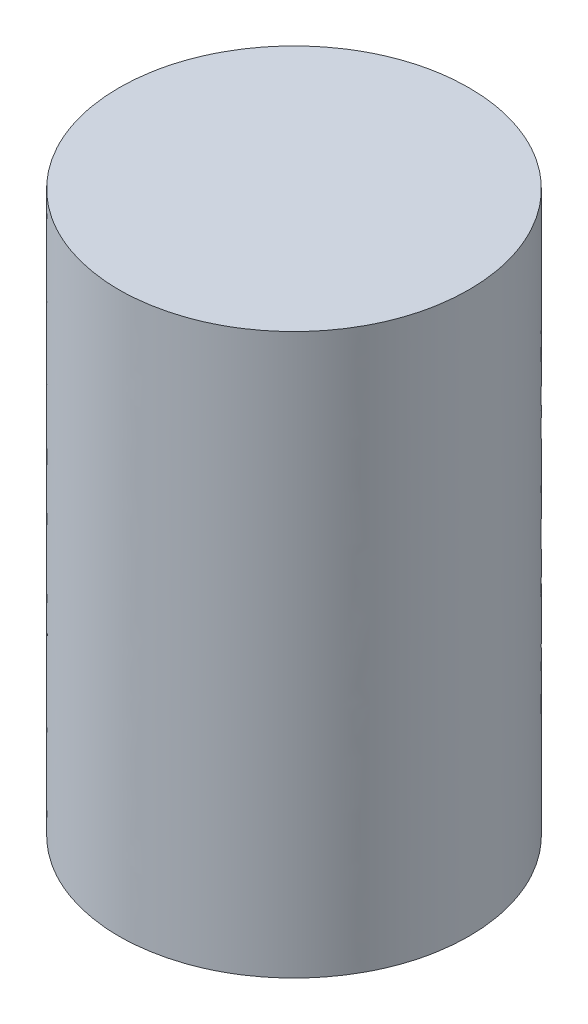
ISO-10303-21;
HEADER;
FILE_DESCRIPTION(('STEP AP214'),'2;1');
FILE_NAME('part.step','',(''),(''),'','','');
FILE_SCHEMA(('AUTOMOTIVE_DESIGN { 1 0 10303 214 1 1 1 1 }'));
ENDSEC;
DATA;
#1=APPLICATION_CONTEXT('core data for automotive mechanical design processes');
#2=APPLICATION_PROTOCOL_DEFINITION('international standard','automotive_design',2000,#1);
#3=PRODUCT_CONTEXT('',#1,'mechanical');
#4=PRODUCT('Part','Part','',(#3));
#5=PRODUCT_RELATED_PRODUCT_CATEGORY('part','',(#4));
#6=PRODUCT_DEFINITION_FORMATION('','',#4);
#7=PRODUCT_DEFINITION_CONTEXT('part definition',#1,'design');
#8=PRODUCT_DEFINITION('design','',#6,#7);
#9=PRODUCT_DEFINITION_SHAPE('','',#8);
#10=(LENGTH_UNIT() NAMED_UNIT(*) SI_UNIT(.MILLI.,.METRE.));
#11=(NAMED_UNIT(*) PLANE_ANGLE_UNIT() SI_UNIT($,.RADIAN.));
#12=(NAMED_UNIT(*) SI_UNIT($,.STERADIAN.) SOLID_ANGLE_UNIT());
#13=UNCERTAINTY_MEASURE_WITH_UNIT(LENGTH_MEASURE(1.E-05),#10,'distance_accuracy_value','');
#14=(GEOMETRIC_REPRESENTATION_CONTEXT(3) GLOBAL_UNCERTAINTY_ASSIGNED_CONTEXT((#13)) GLOBAL_UNIT_ASSIGNED_CONTEXT((#10,
#11,#12)) REPRESENTATION_CONTEXT('',''));
#15=CARTESIAN_POINT('',(0.,0.,0.));
#16=DIRECTION('',(0.,0.,1.));
#17=DIRECTION('',(1.,0.,0.));
#18=AXIS2_PLACEMENT_3D('',#15,#16,#17);
#19=CARTESIAN_POINT('',(0.,0.,0.));
#20=DIRECTION('',(0.,1.,0.));
#21=DIRECTION('',(0.,0.,1.));
#22=AXIS2_PLACEMENT_3D('',#19,#20,#21);
#23=PLANE('',#22);
#24=CARTESIAN_POINT('',(0.,0.,0.));
#25=DIRECTION('',(0.,1.,0.));
#26=DIRECTION('',(0.,0.,1.));
#27=AXIS2_PLACEMENT_3D('',#24,#25,#26);
#28=CIRCLE('',#27,25.);
#29=CARTESIAN_POINT('',(0.,0.,-25.));
#30=VERTEX_POINT('',#29);
#31=EDGE_CURVE('E57',#30,#30,#28,.T.);
#32=ORIENTED_EDGE('',*,*,#31,.F.);
#33=EDGE_LOOP('',(#32));
#34=FACE_BOUND('',#33,.T.);
#35=ADVANCED_FACE('F49',(#34),#23,.F.);
#36=CARTESIAN_POINT('',(0.,80.,0.));
#37=DIRECTION('',(0.,1.,0.));
#38=DIRECTION('',(0.,0.,1.));
#39=AXIS2_PLACEMENT_3D('',#36,#37,#38);
#40=PLANE('',#39);
#41=CARTESIAN_POINT('',(0.,80.,0.));
#42=DIRECTION('',(0.,1.,0.));
#43=DIRECTION('',(0.,0.,1.));
#44=AXIS2_PLACEMENT_3D('',#41,#42,#43);
#45=CIRCLE('',#44,25.);
#46=CARTESIAN_POINT('',(0.,80.,-25.));
#47=VERTEX_POINT('',#46);
#48=EDGE_CURVE('E12',#47,#47,#45,.T.);
#49=ORIENTED_EDGE('',*,*,#48,.T.);
#50=EDGE_LOOP('',(#49));
#51=FACE_BOUND('',#50,.T.);
#52=ADVANCED_FACE('F99',(#51),#40,.T.);
#53=CARTESIAN_POINT('',(0.,80.,-25.));
#54=CARTESIAN_POINT('',(0.,53.3333333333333,-25.));
#55=CARTESIAN_POINT('',(0.,26.6666666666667,-25.));
#56=CARTESIAN_POINT('',(0.,0.,-25.));
#57=CARTESIAN_POINT('',(0.689893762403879,80.,-25.));
#58=CARTESIAN_POINT('',(0.689893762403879,53.3333333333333,-25.));
#59=CARTESIAN_POINT('',(0.689893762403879,26.6666666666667,-25.));
#60=CARTESIAN_POINT('',(0.689893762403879,0.,-25.));
#61=CARTESIAN_POINT('',(2.05670253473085,80.,-24.9439893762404));
#62=CARTESIAN_POINT('',(2.05670253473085,53.3333333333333,-24.9439893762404));
#63=CARTESIAN_POINT('',(2.05670253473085,26.6666666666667,-24.9439893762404));
#64=CARTESIAN_POINT('',(2.05670253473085,0.,-24.9439893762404));
#65=CARTESIAN_POINT('',(4.06152465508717,80.,-24.698396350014));
#66=CARTESIAN_POINT('',(4.06152465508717,53.3333333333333,-24.698396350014));
#67=CARTESIAN_POINT('',(4.06152465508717,26.6666666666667,-24.698396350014));
#68=CARTESIAN_POINT('',(4.06152465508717,0.,-24.698396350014));
#69=CARTESIAN_POINT('',(6.01450095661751,80.,-24.2976810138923));
#70=CARTESIAN_POINT('',(6.01450095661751,53.3333333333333,-24.2976810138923));
#71=CARTESIAN_POINT('',(6.01450095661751,26.6666666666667,-24.2976810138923));
#72=CARTESIAN_POINT('',(6.01450095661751,0.,-24.2976810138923));
#73=CARTESIAN_POINT('',(17.3825551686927,80.,-21.0013838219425));
#74=CARTESIAN_POINT('',(17.3825551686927,53.3333333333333,-21.0013838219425));
#75=CARTESIAN_POINT('',(17.3825551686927,26.6666666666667,-21.0013838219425));
#76=CARTESIAN_POINT('',(17.3825551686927,0.,-21.0013838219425));
#77=CARTESIAN_POINT('',(25.,80.,-11.038300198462));
#78=CARTESIAN_POINT('',(25.,53.3333333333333,-11.038300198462));
#79=CARTESIAN_POINT('',(25.,26.6666666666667,-11.038300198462));
#80=CARTESIAN_POINT('',(25.,0.,-11.038300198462));
#81=CARTESIAN_POINT('',(25.,80.,13.7978752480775));
#82=CARTESIAN_POINT('',(25.,53.3333333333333,13.7978752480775));
#83=CARTESIAN_POINT('',(25.,26.6666666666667,13.7978752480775));
#84=CARTESIAN_POINT('',(25.,0.,13.7978752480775));
#85=CARTESIAN_POINT('',(13.7978752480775,80.,25.));
#86=CARTESIAN_POINT('',(13.7978752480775,53.3333333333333,25.));
#87=CARTESIAN_POINT('',(13.7978752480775,26.6666666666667,25.));
#88=CARTESIAN_POINT('',(13.7978752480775,0.,25.));
#89=CARTESIAN_POINT('',(-13.7978752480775,80.,25.));
#90=CARTESIAN_POINT('',(-13.7978752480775,53.3333333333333,25.));
#91=CARTESIAN_POINT('',(-13.7978752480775,26.6666666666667,25.));
#92=CARTESIAN_POINT('',(-13.7978752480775,0.,25.));
#93=CARTESIAN_POINT('',(-25.,80.,13.7978752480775));
#94=CARTESIAN_POINT('',(-25.,53.3333333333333,13.7978752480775));
#95=CARTESIAN_POINT('',(-25.,26.6666666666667,13.7978752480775));
#96=CARTESIAN_POINT('',(-25.,0.,13.7978752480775));
#97=CARTESIAN_POINT('',(-25.,80.,-11.038300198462));
#98=CARTESIAN_POINT('',(-25.,53.3333333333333,-11.038300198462));
#99=CARTESIAN_POINT('',(-25.,26.6666666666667,-11.038300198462));
#100=CARTESIAN_POINT('',(-25.,0.,-11.038300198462));
#101=CARTESIAN_POINT('',(-17.3825551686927,80.,-21.0013838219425));
#102=CARTESIAN_POINT('',(-17.3825551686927,53.3333333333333,-21.0013838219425));
#103=CARTESIAN_POINT('',(-17.3825551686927,26.6666666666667,-21.0013838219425));
#104=CARTESIAN_POINT('',(-17.3825551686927,0.,-21.0013838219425));
#105=CARTESIAN_POINT('',(-6.0145009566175,80.,-24.2976810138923));
#106=CARTESIAN_POINT('',(-6.0145009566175,53.3333333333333,-24.2976810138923));
#107=CARTESIAN_POINT('',(-6.0145009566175,26.6666666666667,-24.2976810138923));
#108=CARTESIAN_POINT('',(-6.0145009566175,0.,-24.2976810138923));
#109=CARTESIAN_POINT('',(-4.06152465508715,80.,-24.698396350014));
#110=CARTESIAN_POINT('',(-4.06152465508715,53.3333333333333,-24.698396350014));
#111=CARTESIAN_POINT('',(-4.06152465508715,26.6666666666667,-24.698396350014));
#112=CARTESIAN_POINT('',(-4.06152465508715,0.,-24.698396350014));
#113=CARTESIAN_POINT('',(-2.05670253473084,80.,-24.9439893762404));
#114=CARTESIAN_POINT('',(-2.05670253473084,53.3333333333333,-24.9439893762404));
#115=CARTESIAN_POINT('',(-2.05670253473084,26.6666666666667,-24.9439893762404));
#116=CARTESIAN_POINT('',(-2.05670253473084,0.,-24.9439893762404));
#117=CARTESIAN_POINT('',(-0.689893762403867,80.,-25.));
#118=CARTESIAN_POINT('',(-0.689893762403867,53.3333333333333,-25.));
#119=CARTESIAN_POINT('',(-0.689893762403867,26.6666666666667,-25.));
#120=CARTESIAN_POINT('',(-0.689893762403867,0.,-25.));
#121=CARTESIAN_POINT('',(0.,80.,-25.));
#122=CARTESIAN_POINT('',(0.,53.3333333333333,-25.));
#123=CARTESIAN_POINT('',(0.,26.6666666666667,-25.));
#124=CARTESIAN_POINT('',(0.,0.,-25.));
#125=B_SPLINE_SURFACE_WITH_KNOTS('',3,3,((#53,#54,#55,#56),(#57,#58,#59,#60),(#61,#62,#63,#64),
(#65,#66,#67,#68),(#69,#70,#71,#72),(#73,#74,#75,#76),(#77,#78,#79,#80),(#81,#82,#83,#84),(#85,
#86,#87,#88),(#89,#90,#91,#92),(#93,#94,#95,#96),(#97,#98,#99,#100),(#101,#102,#103,#104),(#105,
#106,#107,#108),(#109,#110,#111,#112),(#113,#114,#115,#116),(#117,#118,#119,#120),(#121,#122,
#123,#124)),.UNSPECIFIED.,.T.,.F.,.F.,(4,1,1,1,1,2,2,2,1,1,1,1,4),(4,4),(0.,0.0125,
0.0249999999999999,0.0375000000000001,0.05,0.25,0.5,0.75,0.95,0.9625,0.975,0.9875,1.),(0.,1.),.UNSPECIFIED.);
#126=CARTESIAN_POINT('',(0.,80.,-25.));
#127=CARTESIAN_POINT('',(0.,79.1666666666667,-25.));
#128=CARTESIAN_POINT('',(0.,78.3333333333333,-25.));
#129=CARTESIAN_POINT('',(0.,76.6666666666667,-25.));
#130=CARTESIAN_POINT('',(0.,75.8333333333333,-25.));
#131=CARTESIAN_POINT('',(0.,74.1666666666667,-25.));
#132=CARTESIAN_POINT('',(0.,73.3333333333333,-25.));
#133=CARTESIAN_POINT('',(0.,71.6666666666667,-25.));
#134=CARTESIAN_POINT('',(0.,70.8333333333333,-25.));
#135=CARTESIAN_POINT('',(0.,69.1666666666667,-25.));
#136=CARTESIAN_POINT('',(0.,68.3333333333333,-25.));
#137=CARTESIAN_POINT('',(0.,66.6666666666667,-25.));
#138=CARTESIAN_POINT('',(0.,65.8333333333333,-25.));
#139=CARTESIAN_POINT('',(0.,64.1666666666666,-25.));
#140=CARTESIAN_POINT('',(0.,63.3333333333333,-25.));
#141=CARTESIAN_POINT('',(0.,61.6666666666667,-25.));
#142=CARTESIAN_POINT('',(0.,60.8333333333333,-25.));
#143=CARTESIAN_POINT('',(0.,59.1666666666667,-25.));
#144=CARTESIAN_POINT('',(0.,58.3333333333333,-25.));
#145=CARTESIAN_POINT('',(0.,56.6666666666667,-25.));
#146=CARTESIAN_POINT('',(0.,55.8333333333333,-25.));
#147=CARTESIAN_POINT('',(0.,54.1666666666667,-25.));
#148=CARTESIAN_POINT('',(0.,53.3333333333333,-25.));
#149=CARTESIAN_POINT('',(0.,51.6666666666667,-25.));
#150=CARTESIAN_POINT('',(0.,50.8333333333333,-25.));
#151=CARTESIAN_POINT('',(0.,49.1666666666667,-25.));
#152=CARTESIAN_POINT('',(0.,48.3333333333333,-25.));
#153=CARTESIAN_POINT('',(0.,46.6666666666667,-25.));
#154=CARTESIAN_POINT('',(0.,45.8333333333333,-25.));
#155=CARTESIAN_POINT('',(0.,44.1666666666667,-25.));
#156=CARTESIAN_POINT('',(0.,43.3333333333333,-25.));
#157=CARTESIAN_POINT('',(0.,41.6666666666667,-25.));
#158=CARTESIAN_POINT('',(0.,40.8333333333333,-25.));
#159=CARTESIAN_POINT('',(0.,39.1666666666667,-25.));
#160=CARTESIAN_POINT('',(0.,38.3333333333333,-25.));
#161=CARTESIAN_POINT('',(0.,36.6666666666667,-25.));
#162=CARTESIAN_POINT('',(0.,35.8333333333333,-25.));
#163=CARTESIAN_POINT('',(0.,34.1666666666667,-25.));
#164=CARTESIAN_POINT('',(0.,33.3333333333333,-25.));
#165=CARTESIAN_POINT('',(0.,31.6666666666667,-25.));
#166=CARTESIAN_POINT('',(0.,30.8333333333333,-25.));
#167=CARTESIAN_POINT('',(0.,29.1666666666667,-25.));
#168=CARTESIAN_POINT('',(0.,28.3333333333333,-25.));
#169=CARTESIAN_POINT('',(0.,26.6666666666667,-25.));
#170=CARTESIAN_POINT('',(0.,25.8333333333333,-25.));
#171=CARTESIAN_POINT('',(0.,24.1666666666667,-25.));
#172=CARTESIAN_POINT('',(0.,23.3333333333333,-25.));
#173=CARTESIAN_POINT('',(0.,21.6666666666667,-25.));
#174=CARTESIAN_POINT('',(0.,20.8333333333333,-25.));
#175=CARTESIAN_POINT('',(0.,19.1666666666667,-25.));
#176=CARTESIAN_POINT('',(0.,18.3333333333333,-25.));
#177=CARTESIAN_POINT('',(0.,16.6666666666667,-25.));
#178=CARTESIAN_POINT('',(0.,15.8333333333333,-25.));
#179=CARTESIAN_POINT('',(0.,14.1666666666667,-25.));
#180=CARTESIAN_POINT('',(0.,13.3333333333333,-25.));
#181=CARTESIAN_POINT('',(0.,11.6666666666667,-25.));
#182=CARTESIAN_POINT('',(0.,10.8333333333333,-25.));
#183=CARTESIAN_POINT('',(0.,9.16666666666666,-25.));
#184=CARTESIAN_POINT('',(0.,8.33333333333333,-25.));
#185=CARTESIAN_POINT('',(0.,6.66666666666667,-25.));
#186=CARTESIAN_POINT('',(0.,5.83333333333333,-25.));
#187=CARTESIAN_POINT('',(0.,4.16666666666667,-25.));
#188=CARTESIAN_POINT('',(0.,3.33333333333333,-25.));
#189=CARTESIAN_POINT('',(0.,1.66666666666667,-25.));
#190=CARTESIAN_POINT('',(0.,0.833333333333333,-25.));
#191=CARTESIAN_POINT('',(0.,0.,-25.));
#192=B_SPLINE_CURVE_WITH_KNOTS('',3,(#126,#127,#128,#129,#130,#131,#132,#133,#134,#135,#136,
#137,#138,#139,#140,#141,#142,#143,#144,#145,#146,#147,#148,#149,#150,#151,#152,#153,#154,#155,
#156,#157,#158,#159,#160,#161,#162,#163,#164,#165,#166,#167,#168,#169,#170,#171,#172,#173,#174,
#175,#176,#177,#178,#179,#180,#181,#182,#183,#184,#185,#186,#187,#188,#189,#190,#191),
.UNSPECIFIED.,.F.,.F.,(4,2,2,2,2,2,2,2,2,2,2,2,2,2,2,2,2,2,2,2,2,2,2,2,2,2,2,2,2,2,2,2,4),(0.,
2.49999999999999,5.,7.50000000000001,10.,12.5,15.,17.5,20.,22.5,25.,27.5,30.,32.5,35.,37.5,40.,
42.5,45.,47.5,50.,52.5,55.,57.5,60.,62.5,65.,67.5,70.,72.5,75.,77.5,80.),.UNSPECIFIED.);
#193=EDGE_CURVE('BSEAM82',#47,#30,#192,.T.);
#194=ORIENTED_EDGE('',*,*,#48,.F.);
#195=ORIENTED_EDGE('',*,*,#31,.T.);
#196=ORIENTED_EDGE('',*,*,#193,.T.);
#197=ORIENTED_EDGE('',*,*,#193,.F.);
#198=EDGE_LOOP('',(#194,#196,#195,#197));
#199=FACE_BOUND('',#198,.T.);
#200=ADVANCED_FACE('F82',(#199),#125,.T.);
#201=CLOSED_SHELL('',(#35,#52,#200));
#202=MANIFOLD_SOLID_BREP('B2',#201);
#203=ADVANCED_BREP_SHAPE_REPRESENTATION('',(#18,#202),#14);
#204=SHAPE_DEFINITION_REPRESENTATION(#9,#203);
ENDSEC;
END-ISO-10303-21;
